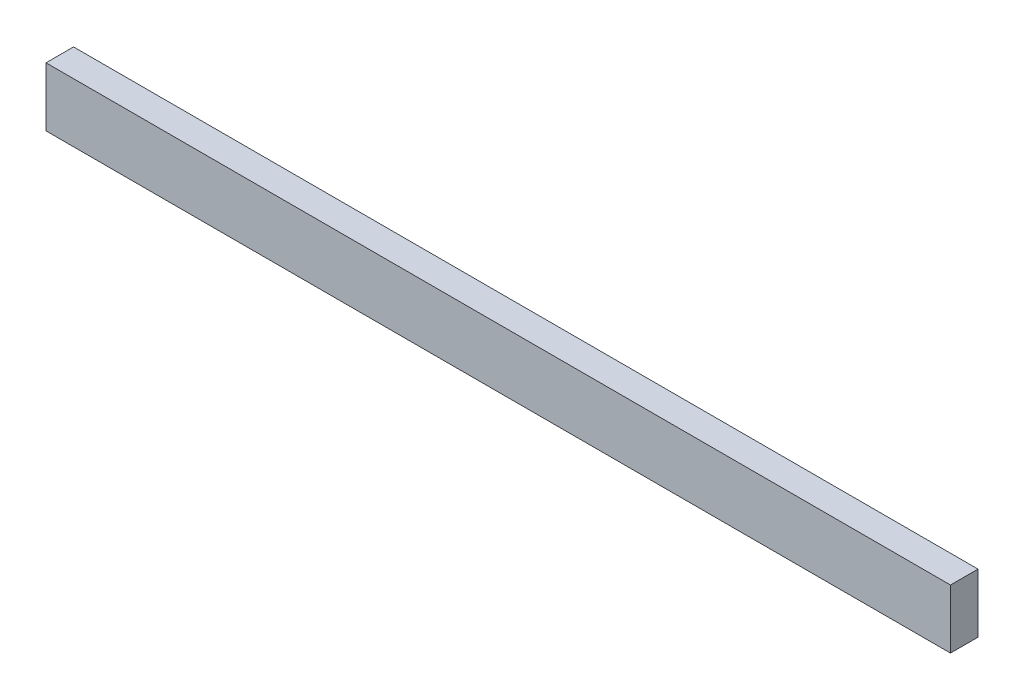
ISO-10303-21;
HEADER;
FILE_DESCRIPTION(('STEP AP214'),'2;1');
FILE_NAME('part.step','',(''),(''),'','','');
FILE_SCHEMA(('AUTOMOTIVE_DESIGN { 1 0 10303 214 1 1 1 1 }'));
ENDSEC;
DATA;
#1=APPLICATION_CONTEXT('core data for automotive mechanical design processes');
#2=APPLICATION_PROTOCOL_DEFINITION('international standard','automotive_design',2000,#1);
#3=PRODUCT_CONTEXT('',#1,'mechanical');
#4=PRODUCT('Part','Part','',(#3));
#5=PRODUCT_RELATED_PRODUCT_CATEGORY('part','',(#4));
#6=PRODUCT_DEFINITION_FORMATION('','',#4);
#7=PRODUCT_DEFINITION_CONTEXT('part definition',#1,'design');
#8=PRODUCT_DEFINITION('design','',#6,#7);
#9=PRODUCT_DEFINITION_SHAPE('','',#8);
#10=(LENGTH_UNIT() NAMED_UNIT(*) SI_UNIT(.MILLI.,.METRE.));
#11=(NAMED_UNIT(*) PLANE_ANGLE_UNIT() SI_UNIT($,.RADIAN.));
#12=(NAMED_UNIT(*) SI_UNIT($,.STERADIAN.) SOLID_ANGLE_UNIT());
#13=UNCERTAINTY_MEASURE_WITH_UNIT(LENGTH_MEASURE(1.E-05),#10,'distance_accuracy_value','');
#14=(GEOMETRIC_REPRESENTATION_CONTEXT(3) GLOBAL_UNCERTAINTY_ASSIGNED_CONTEXT((#13)) GLOBAL_UNIT_ASSIGNED_CONTEXT((#10,
#11,#12)) REPRESENTATION_CONTEXT('',''));
#15=CARTESIAN_POINT('',(0.,0.,0.));
#16=DIRECTION('',(0.,0.,1.));
#17=DIRECTION('',(1.,0.,0.));
#18=AXIS2_PLACEMENT_3D('',#15,#16,#17);
#19=CARTESIAN_POINT('',(137.715377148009,2.23221198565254,8.89));
#20=DIRECTION('',(0.,0.,-1.));
#21=DIRECTION('',(-1.,0.,0.));
#22=AXIS2_PLACEMENT_3D('',#19,#20,#21);
#23=PLANE('',#22);
#24=CARTESIAN_POINT('',(137.715377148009,2.23221198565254,8.89));
#25=DIRECTION('',(0.,0.,-1.));
#26=DIRECTION('',(-1.,0.,0.));
#27=AXIS2_PLACEMENT_3D('',#24,#25,#26);
#28=CIRCLE('',#27,1.26999999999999);
#29=CARTESIAN_POINT('',(136.445377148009,2.23221198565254,8.89));
#30=VERTEX_POINT('',#29);
#31=EDGE_CURVE('E20',#30,#30,#28,.T.);
#32=ORIENTED_EDGE('',*,*,#31,.T.);
#33=EDGE_LOOP('',(#32));
#34=FACE_BOUND('',#33,.T.);
#35=ADVANCED_FACE('F17',(#34),#23,.T.);
#36=CARTESIAN_POINT('',(137.715377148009,-13.8205880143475,8.89));
#37=DIRECTION('',(0.,0.,-1.));
#38=DIRECTION('',(-1.,0.,0.));
#39=AXIS2_PLACEMENT_3D('',#36,#37,#38);
#40=PLANE('',#39);
#41=CARTESIAN_POINT('',(137.715377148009,-13.8205880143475,8.89));
#42=DIRECTION('',(0.,0.,-1.));
#43=DIRECTION('',(-1.,0.,0.));
#44=AXIS2_PLACEMENT_3D('',#41,#42,#43);
#45=CIRCLE('',#44,1.26999999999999);
#46=CARTESIAN_POINT('',(136.445377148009,-13.8205880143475,8.89));
#47=VERTEX_POINT('',#46);
#48=EDGE_CURVE('E147',#47,#47,#45,.T.);
#49=ORIENTED_EDGE('',*,*,#48,.T.);
#50=EDGE_LOOP('',(#49));
#51=FACE_BOUND('',#50,.T.);
#52=ADVANCED_FACE('F240',(#51),#40,.T.);
#53=CARTESIAN_POINT('',(102.155377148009,2.23221198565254,8.89));
#54=DIRECTION('',(0.,0.,-1.));
#55=DIRECTION('',(-1.,0.,0.));
#56=AXIS2_PLACEMENT_3D('',#53,#54,#55);
#57=PLANE('',#56);
#58=CARTESIAN_POINT('',(102.155377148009,2.23221198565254,8.89));
#59=DIRECTION('',(0.,0.,-1.));
#60=DIRECTION('',(-1.,0.,0.));
#61=AXIS2_PLACEMENT_3D('',#58,#59,#60);
#62=CIRCLE('',#61,1.26999999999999);
#63=CARTESIAN_POINT('',(100.885377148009,2.23221198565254,8.89));
#64=VERTEX_POINT('',#63);
#65=EDGE_CURVE('E145',#64,#64,#62,.T.);
#66=ORIENTED_EDGE('',*,*,#65,.T.);
#67=EDGE_LOOP('',(#66));
#68=FACE_BOUND('',#67,.T.);
#69=ADVANCED_FACE('F237',(#68),#57,.T.);
#70=CARTESIAN_POINT('',(102.155377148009,-13.8205880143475,8.89));
#71=DIRECTION('',(0.,0.,-1.));
#72=DIRECTION('',(-1.,0.,0.));
#73=AXIS2_PLACEMENT_3D('',#70,#71,#72);
#74=PLANE('',#73);
#75=CARTESIAN_POINT('',(102.155377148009,-13.8205880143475,8.89));
#76=DIRECTION('',(0.,0.,-1.));
#77=DIRECTION('',(-1.,0.,0.));
#78=AXIS2_PLACEMENT_3D('',#75,#76,#77);
#79=CIRCLE('',#78,1.26999999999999);
#80=CARTESIAN_POINT('',(100.885377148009,-13.8205880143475,8.89));
#81=VERTEX_POINT('',#80);
#82=EDGE_CURVE('E142',#81,#81,#79,.T.);
#83=ORIENTED_EDGE('',*,*,#82,.T.);
#84=EDGE_LOOP('',(#83));
#85=FACE_BOUND('',#84,.T.);
#86=ADVANCED_FACE('F239',(#85),#74,.T.);
#87=CARTESIAN_POINT('',(518.715377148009,-13.8205880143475,8.89));
#88=DIRECTION('',(0.,0.,1.));
#89=DIRECTION('',(1.,0.,0.));
#90=AXIS2_PLACEMENT_3D('',#87,#88,#89);
#91=PLANE('',#90);
#92=CARTESIAN_POINT('',(518.715377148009,-13.8205880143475,8.89));
#93=DIRECTION('',(0.,0.,-1.));
#94=DIRECTION('',(-1.,0.,0.));
#95=AXIS2_PLACEMENT_3D('',#92,#93,#94);
#96=CIRCLE('',#95,1.26999999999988);
#97=CARTESIAN_POINT('',(517.445377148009,-13.8205880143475,8.89));
#98=VERTEX_POINT('',#97);
#99=EDGE_CURVE('E139',#98,#98,#96,.T.);
#100=ORIENTED_EDGE('',*,*,#99,.T.);
#101=EDGE_LOOP('',(#100));
#102=FACE_BOUND('',#101,.T.);
#103=ADVANCED_FACE('F246',(#102),#91,.F.);
#104=CARTESIAN_POINT('',(518.715377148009,2.23221198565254,8.89));
#105=DIRECTION('',(0.,0.,1.));
#106=DIRECTION('',(1.,0.,0.));
#107=AXIS2_PLACEMENT_3D('',#104,#105,#106);
#108=PLANE('',#107);
#109=CARTESIAN_POINT('',(518.715377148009,2.23221198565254,8.89));
#110=DIRECTION('',(0.,0.,-1.));
#111=DIRECTION('',(-1.,0.,0.));
#112=AXIS2_PLACEMENT_3D('',#109,#110,#111);
#113=CIRCLE('',#112,1.26999999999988);
#114=CARTESIAN_POINT('',(517.445377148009,2.23221198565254,8.89));
#115=VERTEX_POINT('',#114);
#116=EDGE_CURVE('E136',#115,#115,#113,.T.);
#117=ORIENTED_EDGE('',*,*,#116,.T.);
#118=EDGE_LOOP('',(#117));
#119=FACE_BOUND('',#118,.T.);
#120=ADVANCED_FACE('F252',(#119),#108,.F.);
#121=CARTESIAN_POINT('',(483.155377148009,-13.8205880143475,8.89));
#122=DIRECTION('',(0.,0.,1.));
#123=DIRECTION('',(1.,0.,0.));
#124=AXIS2_PLACEMENT_3D('',#121,#122,#123);
#125=PLANE('',#124);
#126=CARTESIAN_POINT('',(483.155377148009,-13.8205880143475,8.89));
#127=DIRECTION('',(0.,0.,-1.));
#128=DIRECTION('',(-1.,0.,0.));
#129=AXIS2_PLACEMENT_3D('',#126,#127,#128);
#130=CIRCLE('',#129,1.26999999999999);
#131=CARTESIAN_POINT('',(481.885377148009,-13.8205880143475,8.89));
#132=VERTEX_POINT('',#131);
#133=EDGE_CURVE('E133',#132,#132,#130,.T.);
#134=ORIENTED_EDGE('',*,*,#133,.T.);
#135=EDGE_LOOP('',(#134));
#136=FACE_BOUND('',#135,.T.);
#137=ADVANCED_FACE('F256',(#136),#125,.F.);
#138=CARTESIAN_POINT('',(483.155377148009,2.23221198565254,8.89));
#139=DIRECTION('',(0.,0.,1.));
#140=DIRECTION('',(1.,0.,0.));
#141=AXIS2_PLACEMENT_3D('',#138,#139,#140);
#142=PLANE('',#141);
#143=CARTESIAN_POINT('',(483.155377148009,2.23221198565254,8.89));
#144=DIRECTION('',(0.,0.,-1.));
#145=DIRECTION('',(-1.,0.,0.));
#146=AXIS2_PLACEMENT_3D('',#143,#144,#145);
#147=CIRCLE('',#146,1.26999999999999);
#148=CARTESIAN_POINT('',(481.885377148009,2.23221198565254,8.89));
#149=VERTEX_POINT('',#148);
#150=EDGE_CURVE('E130',#149,#149,#147,.T.);
#151=ORIENTED_EDGE('',*,*,#150,.T.);
#152=EDGE_LOOP('',(#151));
#153=FACE_BOUND('',#152,.T.);
#154=ADVANCED_FACE('F260',(#153),#142,.F.);
#155=CARTESIAN_POINT('',(558.321720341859,-13.0077880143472,12.7));
#156=DIRECTION('',(0.,0.,1.));
#157=DIRECTION('',(1.,0.,0.));
#158=AXIS2_PLACEMENT_3D('',#155,#156,#157);
#159=PLANE('',#158);
#160=CARTESIAN_POINT('',(558.321720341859,-13.0077880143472,12.7));
#161=DIRECTION('',(0.,0.,-1.));
#162=DIRECTION('',(-1.,0.,0.));
#163=AXIS2_PLACEMENT_3D('',#160,#161,#162);
#164=CIRCLE('',#163,1.26999999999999);
#165=CARTESIAN_POINT('',(557.051720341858,-13.0077880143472,12.7));
#166=VERTEX_POINT('',#165);
#167=EDGE_CURVE('E127',#166,#166,#164,.T.);
#168=ORIENTED_EDGE('',*,*,#167,.T.);
#169=EDGE_LOOP('',(#168));
#170=FACE_BOUND('',#169,.T.);
#171=ADVANCED_FACE('F264',(#170),#159,.F.);
#172=CARTESIAN_POINT('',(395.847990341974,-13.0077880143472,12.7));
#173=DIRECTION('',(0.,0.,1.));
#174=DIRECTION('',(1.,0.,0.));
#175=AXIS2_PLACEMENT_3D('',#172,#173,#174);
#176=PLANE('',#175);
#177=CARTESIAN_POINT('',(395.847990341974,-13.0077880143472,12.7));
#178=DIRECTION('',(0.,0.,-1.));
#179=DIRECTION('',(-1.,0.,0.));
#180=AXIS2_PLACEMENT_3D('',#177,#178,#179);
#181=CIRCLE('',#180,1.27000000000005);
#182=CARTESIAN_POINT('',(394.577990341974,-13.0077880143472,12.7));
#183=VERTEX_POINT('',#182);
#184=EDGE_CURVE('E124',#183,#183,#181,.T.);
#185=ORIENTED_EDGE('',*,*,#184,.T.);
#186=EDGE_LOOP('',(#185));
#187=FACE_BOUND('',#186,.T.);
#188=ADVANCED_FACE('F268',(#187),#176,.F.);
#189=CARTESIAN_POINT('',(237.255677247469,-13.0077880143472,12.7));
#190=DIRECTION('',(0.,0.,1.));
#191=DIRECTION('',(1.,0.,0.));
#192=AXIS2_PLACEMENT_3D('',#189,#190,#191);
#193=PLANE('',#192);
#194=CARTESIAN_POINT('',(237.255677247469,-13.0077880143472,12.7));
#195=DIRECTION('',(0.,0.,-1.));
#196=DIRECTION('',(-1.,0.,0.));
#197=AXIS2_PLACEMENT_3D('',#194,#195,#196);
#198=CIRCLE('',#197,1.27000000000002);
#199=CARTESIAN_POINT('',(235.985677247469,-13.0077880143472,12.7));
#200=VERTEX_POINT('',#199);
#201=EDGE_CURVE('E121',#200,#200,#198,.T.);
#202=ORIENTED_EDGE('',*,*,#201,.T.);
#203=EDGE_LOOP('',(#202));
#204=FACE_BOUND('',#203,.T.);
#205=ADVANCED_FACE('F169',(#204),#193,.F.);
#206=CARTESIAN_POINT('',(53.3822214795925,-13.0077880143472,12.7));
#207=DIRECTION('',(0.,0.,1.));
#208=DIRECTION('',(1.,0.,0.));
#209=AXIS2_PLACEMENT_3D('',#206,#207,#208);
#210=PLANE('',#209);
#211=CARTESIAN_POINT('',(53.3822214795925,-13.0077880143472,12.7));
#212=DIRECTION('',(0.,0.,-1.));
#213=DIRECTION('',(-1.,0.,0.));
#214=AXIS2_PLACEMENT_3D('',#211,#212,#213);
#215=CIRCLE('',#214,1.27000000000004);
#216=CARTESIAN_POINT('',(52.1122214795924,-13.0077880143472,12.7));
#217=VERTEX_POINT('',#216);
#218=EDGE_CURVE('E118',#217,#217,#215,.T.);
#219=ORIENTED_EDGE('',*,*,#218,.T.);
#220=EDGE_LOOP('',(#219));
#221=FACE_BOUND('',#220,.T.);
#222=ADVANCED_FACE('F158',(#221),#210,.F.);
#223=CARTESIAN_POINT('',(137.715377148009,2.23221198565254,8.89));
#224=DIRECTION('',(0.,0.,-1.));
#225=DIRECTION('',(-1.,0.,0.));
#226=AXIS2_PLACEMENT_3D('',#223,#224,#225);
#227=CYLINDRICAL_SURFACE('',#226,1.26999999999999);
#228=CARTESIAN_POINT('',(137.715377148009,2.23221198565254,6.096));
#229=DIRECTION('',(0.,0.,-1.));
#230=DIRECTION('',(-1.,0.,0.));
#231=AXIS2_PLACEMENT_3D('',#228,#229,#230);
#232=CIRCLE('',#231,1.26999999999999);
#233=CARTESIAN_POINT('',(136.445377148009,2.23221198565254,6.096));
#234=VERTEX_POINT('',#233);
#235=EDGE_CURVE('E115',#234,#234,#232,.T.);
#236=ORIENTED_EDGE('',*,*,#235,.T.);
#237=EDGE_LOOP('',(#236));
#238=FACE_BOUND('',#237,.T.);
#239=ORIENTED_EDGE('',*,*,#31,.F.);
#240=EDGE_LOOP('',(#239));
#241=FACE_BOUND('',#240,.T.);
#242=ADVANCED_FACE('F155',(#238,#241),#227,.F.);
#243=CARTESIAN_POINT('',(137.715377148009,-13.8205880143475,8.89));
#244=DIRECTION('',(0.,0.,-1.));
#245=DIRECTION('',(-1.,0.,0.));
#246=AXIS2_PLACEMENT_3D('',#243,#244,#245);
#247=CYLINDRICAL_SURFACE('',#246,1.26999999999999);
#248=CARTESIAN_POINT('',(137.715377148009,-13.8205880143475,6.096));
#249=DIRECTION('',(0.,0.,-1.));
#250=DIRECTION('',(-1.,0.,0.));
#251=AXIS2_PLACEMENT_3D('',#248,#249,#250);
#252=CIRCLE('',#251,1.26999999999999);
#253=CARTESIAN_POINT('',(136.445377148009,-13.8205880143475,6.096));
#254=VERTEX_POINT('',#253);
#255=EDGE_CURVE('E112',#254,#254,#252,.T.);
#256=ORIENTED_EDGE('',*,*,#255,.T.);
#257=EDGE_LOOP('',(#256));
#258=FACE_BOUND('',#257,.T.);
#259=ORIENTED_EDGE('',*,*,#48,.F.);
#260=EDGE_LOOP('',(#259));
#261=FACE_BOUND('',#260,.T.);
#262=ADVANCED_FACE('F157',(#258,#261),#247,.F.);
#263=CARTESIAN_POINT('',(102.155377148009,2.23221198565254,8.89));
#264=DIRECTION('',(0.,0.,-1.));
#265=DIRECTION('',(-1.,0.,0.));
#266=AXIS2_PLACEMENT_3D('',#263,#264,#265);
#267=CYLINDRICAL_SURFACE('',#266,1.26999999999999);
#268=CARTESIAN_POINT('',(102.155377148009,2.23221198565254,6.096));
#269=DIRECTION('',(0.,0.,-1.));
#270=DIRECTION('',(-1.,0.,0.));
#271=AXIS2_PLACEMENT_3D('',#268,#269,#270);
#272=CIRCLE('',#271,1.26999999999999);
#273=CARTESIAN_POINT('',(100.885377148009,2.23221198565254,6.096));
#274=VERTEX_POINT('',#273);
#275=EDGE_CURVE('E109',#274,#274,#272,.T.);
#276=ORIENTED_EDGE('',*,*,#275,.T.);
#277=EDGE_LOOP('',(#276));
#278=FACE_BOUND('',#277,.T.);
#279=ORIENTED_EDGE('',*,*,#65,.F.);
#280=EDGE_LOOP('',(#279));
#281=FACE_BOUND('',#280,.T.);
#282=ADVANCED_FACE('F166',(#278,#281),#267,.F.);
#283=CARTESIAN_POINT('',(102.155377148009,-13.8205880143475,8.89));
#284=DIRECTION('',(0.,0.,-1.));
#285=DIRECTION('',(-1.,0.,0.));
#286=AXIS2_PLACEMENT_3D('',#283,#284,#285);
#287=CYLINDRICAL_SURFACE('',#286,1.26999999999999);
#288=CARTESIAN_POINT('',(102.155377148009,-13.8205880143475,6.096));
#289=DIRECTION('',(0.,0.,-1.));
#290=DIRECTION('',(-1.,0.,0.));
#291=AXIS2_PLACEMENT_3D('',#288,#289,#290);
#292=CIRCLE('',#291,1.26999999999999);
#293=CARTESIAN_POINT('',(100.885377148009,-13.8205880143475,6.096));
#294=VERTEX_POINT('',#293);
#295=EDGE_CURVE('E106',#294,#294,#292,.T.);
#296=ORIENTED_EDGE('',*,*,#295,.T.);
#297=EDGE_LOOP('',(#296));
#298=FACE_BOUND('',#297,.T.);
#299=ORIENTED_EDGE('',*,*,#82,.F.);
#300=EDGE_LOOP('',(#299));
#301=FACE_BOUND('',#300,.T.);
#302=ADVANCED_FACE('F224',(#298,#301),#287,.F.);
#303=CARTESIAN_POINT('',(518.715377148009,-13.8205880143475,8.89));
#304=DIRECTION('',(0.,0.,-1.));
#305=DIRECTION('',(-1.,0.,0.));
#306=AXIS2_PLACEMENT_3D('',#303,#304,#305);
#307=CYLINDRICAL_SURFACE('',#306,1.26999999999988);
#308=CARTESIAN_POINT('',(518.715377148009,-13.8205880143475,6.096));
#309=DIRECTION('',(0.,0.,-1.));
#310=DIRECTION('',(-1.,0.,0.));
#311=AXIS2_PLACEMENT_3D('',#308,#309,#310);
#312=CIRCLE('',#311,1.26999999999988);
#313=CARTESIAN_POINT('',(517.445377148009,-13.8205880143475,6.096));
#314=VERTEX_POINT('',#313);
#315=EDGE_CURVE('E103',#314,#314,#312,.T.);
#316=ORIENTED_EDGE('',*,*,#315,.T.);
#317=EDGE_LOOP('',(#316));
#318=FACE_BOUND('',#317,.T.);
#319=ORIENTED_EDGE('',*,*,#99,.F.);
#320=EDGE_LOOP('',(#319));
#321=FACE_BOUND('',#320,.T.);
#322=ADVANCED_FACE('F220',(#318,#321),#307,.F.);
#323=CARTESIAN_POINT('',(518.715377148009,2.23221198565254,8.89));
#324=DIRECTION('',(0.,0.,-1.));
#325=DIRECTION('',(-1.,0.,0.));
#326=AXIS2_PLACEMENT_3D('',#323,#324,#325);
#327=CYLINDRICAL_SURFACE('',#326,1.26999999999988);
#328=CARTESIAN_POINT('',(518.715377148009,2.23221198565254,6.096));
#329=DIRECTION('',(0.,0.,-1.));
#330=DIRECTION('',(-1.,0.,0.));
#331=AXIS2_PLACEMENT_3D('',#328,#329,#330);
#332=CIRCLE('',#331,1.26999999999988);
#333=CARTESIAN_POINT('',(517.445377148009,2.23221198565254,6.096));
#334=VERTEX_POINT('',#333);
#335=EDGE_CURVE('E100',#334,#334,#332,.T.);
#336=ORIENTED_EDGE('',*,*,#335,.T.);
#337=EDGE_LOOP('',(#336));
#338=FACE_BOUND('',#337,.T.);
#339=ORIENTED_EDGE('',*,*,#116,.F.);
#340=EDGE_LOOP('',(#339));
#341=FACE_BOUND('',#340,.T.);
#342=ADVANCED_FACE('F216',(#338,#341),#327,.F.);
#343=CARTESIAN_POINT('',(483.155377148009,-13.8205880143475,8.89));
#344=DIRECTION('',(0.,0.,-1.));
#345=DIRECTION('',(-1.,0.,0.));
#346=AXIS2_PLACEMENT_3D('',#343,#344,#345);
#347=CYLINDRICAL_SURFACE('',#346,1.26999999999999);
#348=CARTESIAN_POINT('',(483.155377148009,-13.8205880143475,6.096));
#349=DIRECTION('',(0.,0.,-1.));
#350=DIRECTION('',(-1.,0.,0.));
#351=AXIS2_PLACEMENT_3D('',#348,#349,#350);
#352=CIRCLE('',#351,1.26999999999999);
#353=CARTESIAN_POINT('',(481.885377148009,-13.8205880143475,6.096));
#354=VERTEX_POINT('',#353);
#355=EDGE_CURVE('E97',#354,#354,#352,.T.);
#356=ORIENTED_EDGE('',*,*,#355,.T.);
#357=EDGE_LOOP('',(#356));
#358=FACE_BOUND('',#357,.T.);
#359=ORIENTED_EDGE('',*,*,#133,.F.);
#360=EDGE_LOOP('',(#359));
#361=FACE_BOUND('',#360,.T.);
#362=ADVANCED_FACE('F212',(#358,#361),#347,.F.);
#363=CARTESIAN_POINT('',(483.155377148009,2.23221198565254,8.89));
#364=DIRECTION('',(0.,0.,-1.));
#365=DIRECTION('',(-1.,0.,0.));
#366=AXIS2_PLACEMENT_3D('',#363,#364,#365);
#367=CYLINDRICAL_SURFACE('',#366,1.26999999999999);
#368=CARTESIAN_POINT('',(483.155377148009,2.23221198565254,6.096));
#369=DIRECTION('',(0.,0.,-1.));
#370=DIRECTION('',(-1.,0.,0.));
#371=AXIS2_PLACEMENT_3D('',#368,#369,#370);
#372=CIRCLE('',#371,1.26999999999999);
#373=CARTESIAN_POINT('',(481.885377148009,2.23221198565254,6.096));
#374=VERTEX_POINT('',#373);
#375=EDGE_CURVE('E94',#374,#374,#372,.T.);
#376=ORIENTED_EDGE('',*,*,#375,.T.);
#377=EDGE_LOOP('',(#376));
#378=FACE_BOUND('',#377,.T.);
#379=ORIENTED_EDGE('',*,*,#150,.F.);
#380=EDGE_LOOP('',(#379));
#381=FACE_BOUND('',#380,.T.);
#382=ADVANCED_FACE('F208',(#378,#381),#367,.F.);
#383=CARTESIAN_POINT('',(558.321720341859,-13.0077880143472,12.7));
#384=DIRECTION('',(0.,0.,-1.));
#385=DIRECTION('',(-1.,0.,0.));
#386=AXIS2_PLACEMENT_3D('',#383,#384,#385);
#387=CYLINDRICAL_SURFACE('',#386,1.26999999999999);
#388=CARTESIAN_POINT('',(558.321720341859,-13.0077880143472,6.096));
#389=DIRECTION('',(0.,0.,-1.));
#390=DIRECTION('',(-1.,0.,0.));
#391=AXIS2_PLACEMENT_3D('',#388,#389,#390);
#392=CIRCLE('',#391,1.26999999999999);
#393=CARTESIAN_POINT('',(557.051720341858,-13.0077880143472,6.096));
#394=VERTEX_POINT('',#393);
#395=EDGE_CURVE('E91',#394,#394,#392,.T.);
#396=ORIENTED_EDGE('',*,*,#395,.T.);
#397=EDGE_LOOP('',(#396));
#398=FACE_BOUND('',#397,.T.);
#399=ORIENTED_EDGE('',*,*,#167,.F.);
#400=EDGE_LOOP('',(#399));
#401=FACE_BOUND('',#400,.T.);
#402=ADVANCED_FACE('F204',(#398,#401),#387,.F.);
#403=CARTESIAN_POINT('',(395.847990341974,-13.0077880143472,12.7));
#404=DIRECTION('',(0.,0.,-1.));
#405=DIRECTION('',(-1.,0.,0.));
#406=AXIS2_PLACEMENT_3D('',#403,#404,#405);
#407=CYLINDRICAL_SURFACE('',#406,1.27000000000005);
#408=CARTESIAN_POINT('',(395.847990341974,-13.0077880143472,6.096));
#409=DIRECTION('',(0.,0.,-1.));
#410=DIRECTION('',(-1.,0.,0.));
#411=AXIS2_PLACEMENT_3D('',#408,#409,#410);
#412=CIRCLE('',#411,1.27000000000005);
#413=CARTESIAN_POINT('',(394.577990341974,-13.0077880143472,6.096));
#414=VERTEX_POINT('',#413);
#415=EDGE_CURVE('E88',#414,#414,#412,.T.);
#416=ORIENTED_EDGE('',*,*,#415,.T.);
#417=EDGE_LOOP('',(#416));
#418=FACE_BOUND('',#417,.T.);
#419=ORIENTED_EDGE('',*,*,#184,.F.);
#420=EDGE_LOOP('',(#419));
#421=FACE_BOUND('',#420,.T.);
#422=ADVANCED_FACE('F200',(#418,#421),#407,.F.);
#423=CARTESIAN_POINT('',(237.255677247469,-13.0077880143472,12.7));
#424=DIRECTION('',(0.,0.,-1.));
#425=DIRECTION('',(-1.,0.,0.));
#426=AXIS2_PLACEMENT_3D('',#423,#424,#425);
#427=CYLINDRICAL_SURFACE('',#426,1.27000000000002);
#428=CARTESIAN_POINT('',(237.255677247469,-13.0077880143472,6.096));
#429=DIRECTION('',(0.,0.,-1.));
#430=DIRECTION('',(-1.,0.,0.));
#431=AXIS2_PLACEMENT_3D('',#428,#429,#430);
#432=CIRCLE('',#431,1.27000000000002);
#433=CARTESIAN_POINT('',(235.985677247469,-13.0077880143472,6.096));
#434=VERTEX_POINT('',#433);
#435=EDGE_CURVE('E85',#434,#434,#432,.T.);
#436=ORIENTED_EDGE('',*,*,#435,.T.);
#437=EDGE_LOOP('',(#436));
#438=FACE_BOUND('',#437,.T.);
#439=ORIENTED_EDGE('',*,*,#201,.F.);
#440=EDGE_LOOP('',(#439));
#441=FACE_BOUND('',#440,.T.);
#442=ADVANCED_FACE('F196',(#438,#441),#427,.F.);
#443=CARTESIAN_POINT('',(53.3822214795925,-13.0077880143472,12.7));
#444=DIRECTION('',(0.,0.,-1.));
#445=DIRECTION('',(-1.,0.,0.));
#446=AXIS2_PLACEMENT_3D('',#443,#444,#445);
#447=CYLINDRICAL_SURFACE('',#446,1.27000000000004);
#448=CARTESIAN_POINT('',(53.3822214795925,-13.0077880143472,6.096));
#449=DIRECTION('',(0.,0.,-1.));
#450=DIRECTION('',(-1.,0.,0.));
#451=AXIS2_PLACEMENT_3D('',#448,#449,#450);
#452=CIRCLE('',#451,1.27000000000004);
#453=CARTESIAN_POINT('',(52.1122214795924,-13.0077880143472,6.096));
#454=VERTEX_POINT('',#453);
#455=EDGE_CURVE('E68',#454,#454,#452,.T.);
#456=ORIENTED_EDGE('',*,*,#455,.T.);
#457=EDGE_LOOP('',(#456));
#458=FACE_BOUND('',#457,.T.);
#459=ORIENTED_EDGE('',*,*,#218,.F.);
#460=EDGE_LOOP('',(#459));
#461=FACE_BOUND('',#460,.T.);
#462=ADVANCED_FACE('F193',(#458,#461),#447,.F.);
#463=CARTESIAN_POINT('',(0.,0.,6.096));
#464=DIRECTION('',(0.,0.,1.));
#465=DIRECTION('',(1.,0.,0.));
#466=AXIS2_PLACEMENT_3D('',#463,#464,#465);
#467=PLANE('',#466);
#468=DIRECTION('',(1.,0.,0.));
#469=VECTOR('',#468,1.);
#470=CARTESIAN_POINT('',(0.,-28.2477880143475,6.096));
#471=LINE('',#470,#469);
#472=CARTESIAN_POINT('',(602.535377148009,-28.2477880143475,6.096));
#473=VERTEX_POINT('',#472);
#474=CARTESIAN_POINT('',(18.3353771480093,-28.2477880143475,6.096));
#475=VERTEX_POINT('',#474);
#476=EDGE_CURVE('E438',#473,#475,#471,.F.);
#477=ORIENTED_EDGE('',*,*,#476,.T.);
#478=DIRECTION('',(0.,1.,0.));
#479=VECTOR('',#478,1.);
#480=CARTESIAN_POINT('',(18.3353771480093,0.,6.096));
#481=LINE('',#480,#479);
#482=CARTESIAN_POINT('',(18.3353771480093,9.85221198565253,6.096));
#483=VERTEX_POINT('',#482);
#484=EDGE_CURVE('E55',#483,#475,#481,.F.);
#485=ORIENTED_EDGE('',*,*,#484,.F.);
#486=DIRECTION('',(1.,0.,0.));
#487=VECTOR('',#486,1.);
#488=CARTESIAN_POINT('',(0.,9.85221198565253,6.096));
#489=LINE('',#488,#487);
#490=CARTESIAN_POINT('',(602.535377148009,9.85221198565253,6.096));
#491=VERTEX_POINT('',#490);
#492=EDGE_CURVE('E70',#483,#491,#489,.T.);
#493=ORIENTED_EDGE('',*,*,#492,.T.);
#494=DIRECTION('',(0.,1.,0.));
#495=VECTOR('',#494,1.);
#496=CARTESIAN_POINT('',(602.535377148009,0.,6.096));
#497=LINE('',#496,#495);
#498=EDGE_CURVE('E60',#473,#491,#497,.T.);
#499=ORIENTED_EDGE('',*,*,#498,.F.);
#500=EDGE_LOOP('',(#477,#485,#493,#499));
#501=FACE_BOUND('',#500,.T.);
#502=ORIENTED_EDGE('',*,*,#455,.F.);
#503=EDGE_LOOP('',(#502));
#504=FACE_BOUND('',#503,.T.);
#505=ORIENTED_EDGE('',*,*,#435,.F.);
#506=EDGE_LOOP('',(#505));
#507=FACE_BOUND('',#506,.T.);
#508=ORIENTED_EDGE('',*,*,#415,.F.);
#509=EDGE_LOOP('',(#508));
#510=FACE_BOUND('',#509,.T.);
#511=ORIENTED_EDGE('',*,*,#395,.F.);
#512=EDGE_LOOP('',(#511));
#513=FACE_BOUND('',#512,.T.);
#514=ORIENTED_EDGE('',*,*,#375,.F.);
#515=EDGE_LOOP('',(#514));
#516=FACE_BOUND('',#515,.T.);
#517=ORIENTED_EDGE('',*,*,#355,.F.);
#518=EDGE_LOOP('',(#517));
#519=FACE_BOUND('',#518,.T.);
#520=ORIENTED_EDGE('',*,*,#335,.F.);
#521=EDGE_LOOP('',(#520));
#522=FACE_BOUND('',#521,.T.);
#523=ORIENTED_EDGE('',*,*,#315,.F.);
#524=EDGE_LOOP('',(#523));
#525=FACE_BOUND('',#524,.T.);
#526=ORIENTED_EDGE('',*,*,#295,.F.);
#527=EDGE_LOOP('',(#526));
#528=FACE_BOUND('',#527,.T.);
#529=ORIENTED_EDGE('',*,*,#275,.F.);
#530=EDGE_LOOP('',(#529));
#531=FACE_BOUND('',#530,.T.);
#532=ORIENTED_EDGE('',*,*,#255,.F.);
#533=EDGE_LOOP('',(#532));
#534=FACE_BOUND('',#533,.T.);
#535=ORIENTED_EDGE('',*,*,#235,.F.);
#536=EDGE_LOOP('',(#535));
#537=FACE_BOUND('',#536,.T.);
#538=ADVANCED_FACE('F71',(#501,#504,#507,#510,#513,#516,#519,#522,#525,#528,#531,#534,#537),
#467,.F.);
#539=CARTESIAN_POINT('',(602.535377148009,0.,23.876));
#540=DIRECTION('',(1.,0.,0.));
#541=DIRECTION('',(0.,0.,-1.));
#542=AXIS2_PLACEMENT_3D('',#539,#540,#541);
#543=PLANE('',#542);
#544=DIRECTION('',(0.,1.,0.));
#545=VECTOR('',#544,1.);
#546=CARTESIAN_POINT('',(602.535377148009,0.,23.876));
#547=LINE('',#546,#545);
#548=CARTESIAN_POINT('',(602.535377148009,-28.2477880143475,23.876));
#549=VERTEX_POINT('',#548);
#550=CARTESIAN_POINT('',(602.535377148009,9.85221198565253,23.876));
#551=VERTEX_POINT('',#550);
#552=EDGE_CURVE('E436',#549,#551,#547,.T.);
#553=ORIENTED_EDGE('',*,*,#552,.F.);
#554=DIRECTION('',(0.,0.,1.));
#555=VECTOR('',#554,1.);
#556=CARTESIAN_POINT('',(602.535377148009,-28.2477880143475,23.876));
#557=LINE('',#556,#555);
#558=EDGE_CURVE('E66',#549,#473,#557,.F.);
#559=ORIENTED_EDGE('',*,*,#558,.T.);
#560=ORIENTED_EDGE('',*,*,#498,.T.);
#561=DIRECTION('',(0.,0.,-1.));
#562=VECTOR('',#561,1.);
#563=CARTESIAN_POINT('',(602.535377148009,9.85221198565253,23.876));
#564=LINE('',#563,#562);
#565=EDGE_CURVE('E63',#491,#551,#564,.F.);
#566=ORIENTED_EDGE('',*,*,#565,.T.);
#567=EDGE_LOOP('',(#553,#559,#560,#566));
#568=FACE_BOUND('',#567,.T.);
#569=ADVANCED_FACE('F61',(#568),#543,.T.);
#570=CARTESIAN_POINT('',(0.,9.85221198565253,23.876));
#571=DIRECTION('',(0.,-1.,0.));
#572=DIRECTION('',(0.,0.,-1.));
#573=AXIS2_PLACEMENT_3D('',#570,#571,#572);
#574=PLANE('',#573);
#575=DIRECTION('',(0.,0.,1.));
#576=VECTOR('',#575,1.);
#577=CARTESIAN_POINT('',(18.3353771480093,9.85221198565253,23.876));
#578=LINE('',#577,#576);
#579=CARTESIAN_POINT('',(18.3353771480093,9.85221198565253,23.876));
#580=VERTEX_POINT('',#579);
#581=EDGE_CURVE('E434',#580,#483,#578,.F.);
#582=ORIENTED_EDGE('',*,*,#581,.F.);
#583=DIRECTION('',(1.,0.,0.));
#584=VECTOR('',#583,1.);
#585=CARTESIAN_POINT('',(0.,9.85221198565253,23.876));
#586=LINE('',#585,#584);
#587=EDGE_CURVE('E78',#551,#580,#586,.F.);
#588=ORIENTED_EDGE('',*,*,#587,.F.);
#589=ORIENTED_EDGE('',*,*,#565,.F.);
#590=ORIENTED_EDGE('',*,*,#492,.F.);
#591=EDGE_LOOP('',(#582,#588,#589,#590));
#592=FACE_BOUND('',#591,.T.);
#593=ADVANCED_FACE('F76',(#592),#574,.F.);
#594=CARTESIAN_POINT('',(18.3353771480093,0.,23.876));
#595=DIRECTION('',(-1.,0.,0.));
#596=DIRECTION('',(0.,0.,1.));
#597=AXIS2_PLACEMENT_3D('',#594,#595,#596);
#598=PLANE('',#597);
#599=DIRECTION('',(0.,1.,0.));
#600=VECTOR('',#599,1.);
#601=CARTESIAN_POINT('',(18.3353771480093,0.,23.876));
#602=LINE('',#601,#600);
#603=CARTESIAN_POINT('',(18.3353771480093,-28.2477880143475,23.876));
#604=VERTEX_POINT('',#603);
#605=EDGE_CURVE('E26',#580,#604,#602,.F.);
#606=ORIENTED_EDGE('',*,*,#605,.F.);
#607=ORIENTED_EDGE('',*,*,#581,.T.);
#608=ORIENTED_EDGE('',*,*,#484,.T.);
#609=DIRECTION('',(0.,0.,1.));
#610=VECTOR('',#609,1.);
#611=CARTESIAN_POINT('',(18.3353771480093,-28.2477880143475,23.876));
#612=LINE('',#611,#610);
#613=EDGE_CURVE('E35',#475,#604,#612,.T.);
#614=ORIENTED_EDGE('',*,*,#613,.T.);
#615=EDGE_LOOP('',(#606,#607,#608,#614));
#616=FACE_BOUND('',#615,.T.);
#617=ADVANCED_FACE('F180',(#616),#598,.T.);
#618=CARTESIAN_POINT('',(0.,-28.2477880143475,23.876));
#619=DIRECTION('',(0.,1.,0.));
#620=DIRECTION('',(0.,0.,1.));
#621=AXIS2_PLACEMENT_3D('',#618,#619,#620);
#622=PLANE('',#621);
#623=ORIENTED_EDGE('',*,*,#558,.F.);
#624=DIRECTION('',(1.,0.,0.));
#625=VECTOR('',#624,1.);
#626=CARTESIAN_POINT('',(0.,-28.2477880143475,23.876));
#627=LINE('',#626,#625);
#628=EDGE_CURVE('E11',#604,#549,#627,.T.);
#629=ORIENTED_EDGE('',*,*,#628,.F.);
#630=ORIENTED_EDGE('',*,*,#613,.F.);
#631=ORIENTED_EDGE('',*,*,#476,.F.);
#632=EDGE_LOOP('',(#623,#629,#630,#631));
#633=FACE_BOUND('',#632,.T.);
#634=ADVANCED_FACE('F174',(#633),#622,.F.);
#635=CARTESIAN_POINT('',(0.,0.,23.876));
#636=DIRECTION('',(0.,0.,1.));
#637=DIRECTION('',(1.,0.,0.));
#638=AXIS2_PLACEMENT_3D('',#635,#636,#637);
#639=PLANE('',#638);
#640=ORIENTED_EDGE('',*,*,#605,.T.);
#641=ORIENTED_EDGE('',*,*,#628,.T.);
#642=ORIENTED_EDGE('',*,*,#552,.T.);
#643=ORIENTED_EDGE('',*,*,#587,.T.);
#644=EDGE_LOOP('',(#640,#641,#642,#643));
#645=FACE_BOUND('',#644,.T.);
#646=ADVANCED_FACE('F172',(#645),#639,.T.);
#647=CLOSED_SHELL('',(#35,#52,#69,#86,#103,#120,#137,#154,#171,#188,#205,#222,#242,#262,#282,
#302,#322,#342,#362,#382,#402,#422,#442,#462,#538,#569,#593,#617,#634,#646));
#648=MANIFOLD_SOLID_BREP('B1',#647);
#649=ADVANCED_BREP_SHAPE_REPRESENTATION('',(#18,#648),#14);
#650=SHAPE_DEFINITION_REPRESENTATION(#9,#649);
ENDSEC;
END-ISO-10303-21;
